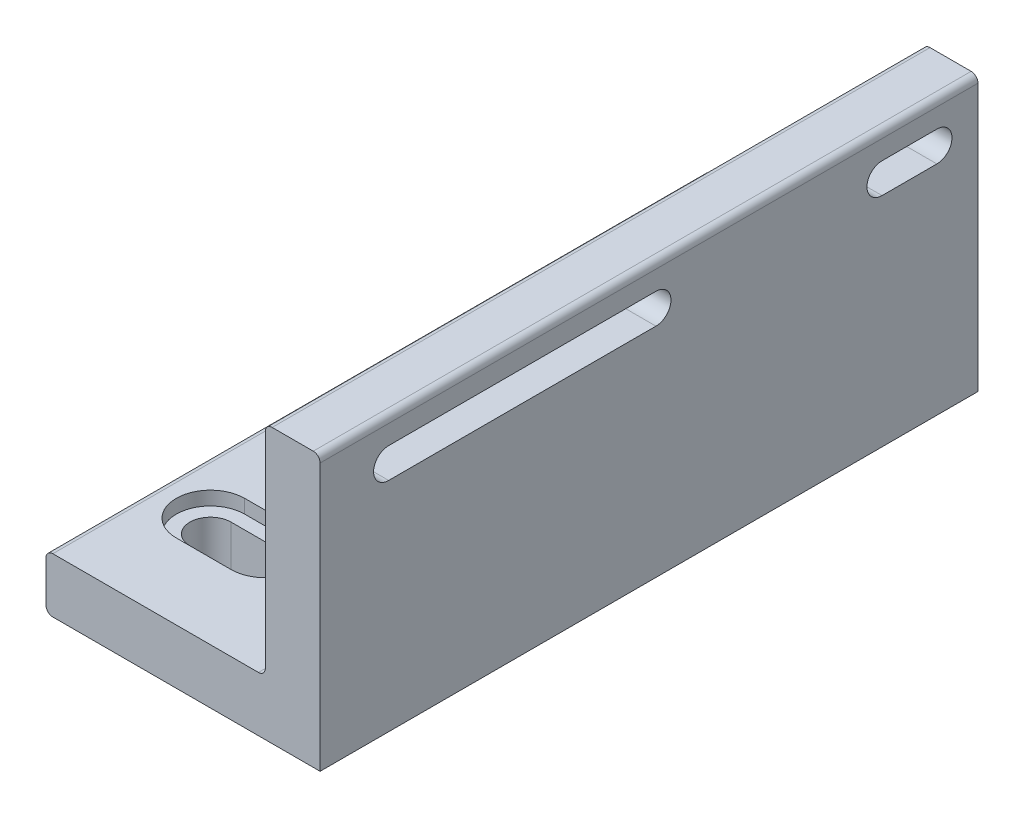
from build123d import *

# Parameters (mm, degrees)
BOSS_EXTRUDE1_DEPTH = 152.4
CUT_EXTRUDE1_DEPTH  = 236.483598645
CUT_EXTRUDE2_DEPTH  = 223.828039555
CUT_EXTRUDE3_DEPTH  = 6.35


with BuildPart() as part:
    # Sketch1 → Boss-Extrude1 (new, symmetric)
    with BuildSketch(Plane.XY):
        with BuildLine():
            Line((-28.575, 25.4), (-123.825, 25.4))
            ThreePointArc((-123.825, 25.4), (-126.07006403, 24.47006403), (-127, 22.225))
            Line((-127, 22.225), (-127, 3.175))
            ThreePointArc((-127, 3.175), (-126.07006403, 0.92993597), (-123.825, 0))
            Line((-123.825, 0), (0, 0))
            Line((0, 0), (0, 123.701968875))
            ThreePointArc((0, 123.701968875), (-0.92993597, 125.947032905), (-3.175, 126.876968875))
            Line((-3.175, 126.876968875), (-22.225, 126.876968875))
            ThreePointArc((-22.225, 126.876968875), (-24.47006403, 125.947032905), (-25.4, 123.701968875))
            Line((-25.4, 123.701968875), (-25.4, 28.575))
            ThreePointArc((-25.4, 28.575), (-26.32993597, 26.32993597), (-28.575, 25.4))
        make_face()
    extrude(amount=BOSS_EXTRUDE1_DEPTH, both=True)

    # Sketch2 → Cut-Extrude1 (cut, through all)
    with BuildSketch(Plane(origin=(0, 0, 0), x_dir=(0, 0, -1), z_dir=(1, 0, 0))):
        with BuildLine():
            Line((-120.65, 114.811968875), (3.175, 114.811968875))
            ThreePointArc((3.175, 114.811968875), (10.16, 107.826968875), (3.175, 100.841968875))
            Line((3.175, 100.841968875), (-120.65, 100.841968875))
            ThreePointArc((-120.65, 100.841968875), (-127.635, 107.826968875), (-120.65, 114.811968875))
        make_face()
        with BuildLine():
            Line((107.95, 114.811968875), (133.35, 114.811968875))
            ThreePointArc((133.35, 114.811968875), (140.335, 107.826968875), (133.35, 100.841968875))
            Line((133.35, 100.841968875), (107.95, 100.841968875))
            ThreePointArc((107.95, 100.841968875), (100.965, 107.826968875), (107.95, 114.811968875))
        make_face()
    extrude(amount=-CUT_EXTRUDE1_DEPTH, mode=Mode.SUBTRACT)

    # Sketch3 → Cut-Extrude2 (cut, through all)
    with BuildSketch(Plane(origin=(0, 25.4, 0), x_dir=(1, 0, 0), z_dir=(0, 1, 0))):
        with BuildLine():
            Line((-101.6, 111.125), (-76.2, 111.125))
            ThreePointArc((-76.2, 111.125), (-66.675, 101.6), (-76.2, 92.075))
            Line((-76.2, 92.075), (-101.6, 92.075))
            ThreePointArc((-101.6, 92.075), (-111.125, 101.6), (-101.6, 111.125))
        make_face()
        with BuildLine():
            Line((-101.6, -111.125), (-76.2, -111.125))
            ThreePointArc((-76.2, -111.125), (-66.675, -101.6), (-76.2, -92.075))
            Line((-76.2, -92.075), (-101.6, -92.075))
            ThreePointArc((-101.6, -92.075), (-111.125, -101.6), (-101.6, -111.125))
        make_face()
    extrude(amount=-CUT_EXTRUDE2_DEPTH, mode=Mode.SUBTRACT)

    # Sketch4 → Cut-Extrude3 (cut)
    with BuildSketch(Plane(origin=(0, 25.4, 0), x_dir=(1, 0, 0), z_dir=(0, 1, 0))):
        with BuildLine():
            Line((-101.6, 85.725), (-76.2, 85.725))
            ThreePointArc((-76.2, 85.725), (-60.325, 101.6), (-76.2, 117.475))
            Line((-76.2, 117.475), (-101.6, 117.475))
            ThreePointArc((-101.6, 117.475), (-117.475, 101.6), (-101.6, 85.725))
        make_face()
        with BuildLine():
            Line((-101.6, -117.475), (-76.2, -117.475))
            ThreePointArc((-76.2, -117.475), (-60.325, -101.6), (-76.2, -85.725))
            Line((-76.2, -85.725), (-101.6, -85.725))
            ThreePointArc((-101.6, -85.725), (-117.475, -101.6), (-101.6, -117.475))
        make_face()
    extrude(amount=-CUT_EXTRUDE3_DEPTH, mode=Mode.SUBTRACT)


solid = part.part
